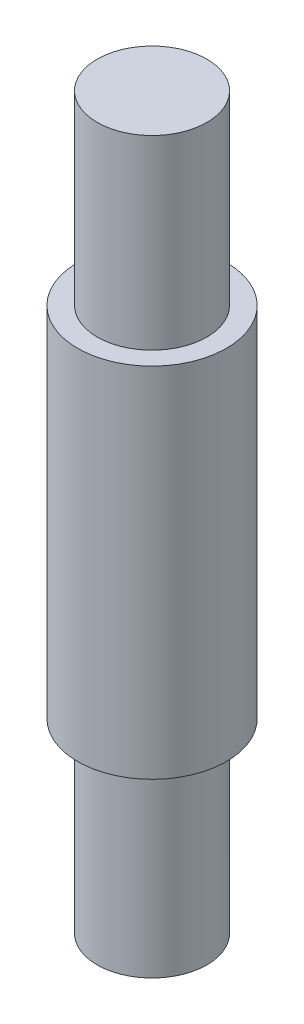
from build123d import *

# Parameters (mm, degrees)
SKETCH1_R           = 0.8
BOSS_EXTRUDE1_DEPTH = 3.85
SKETCH2_R           = 0.59
BOSS_EXTRUDE2_DEPTH = 2
BOSS_EXTRUDE3_START = 2
SKETCH3_R           = 0.59
BOSS_EXTRUDE3_DEPTH = 2


with BuildPart() as part:
    # Sketch1 → Boss-Extrude1 (new body)
    with BuildSketch(Plane(origin=(0, 0, 0), x_dir=(1, 0, 0), z_dir=(0, 1, 0))):
        with Locations(Location((0, 0, 0), (0, 0, 90))):
            Circle(SKETCH1_R)
    extrude(amount=BOSS_EXTRUDE1_DEPTH)

    # Sketch2 → Boss-Extrude2 (add)
    with BuildSketch(Plane(origin=(0, 3.85, 0), x_dir=(1, 0, 0), z_dir=(0, 1, 0))):
        with Locations(Location((0, 0, 0), (0, 0, 270))):
            Circle(SKETCH2_R)
    extrude(amount=BOSS_EXTRUDE2_DEPTH)

    # Sketch3 → Boss-Extrude3 (add)
    with BuildSketch(Plane.XZ.offset(BOSS_EXTRUDE3_START)):
        with Locations(Location((0, 0, 0), (0, 0, 90))):
            Circle(SKETCH3_R)
    extrude(amount=-BOSS_EXTRUDE3_DEPTH)


solid = part.part
